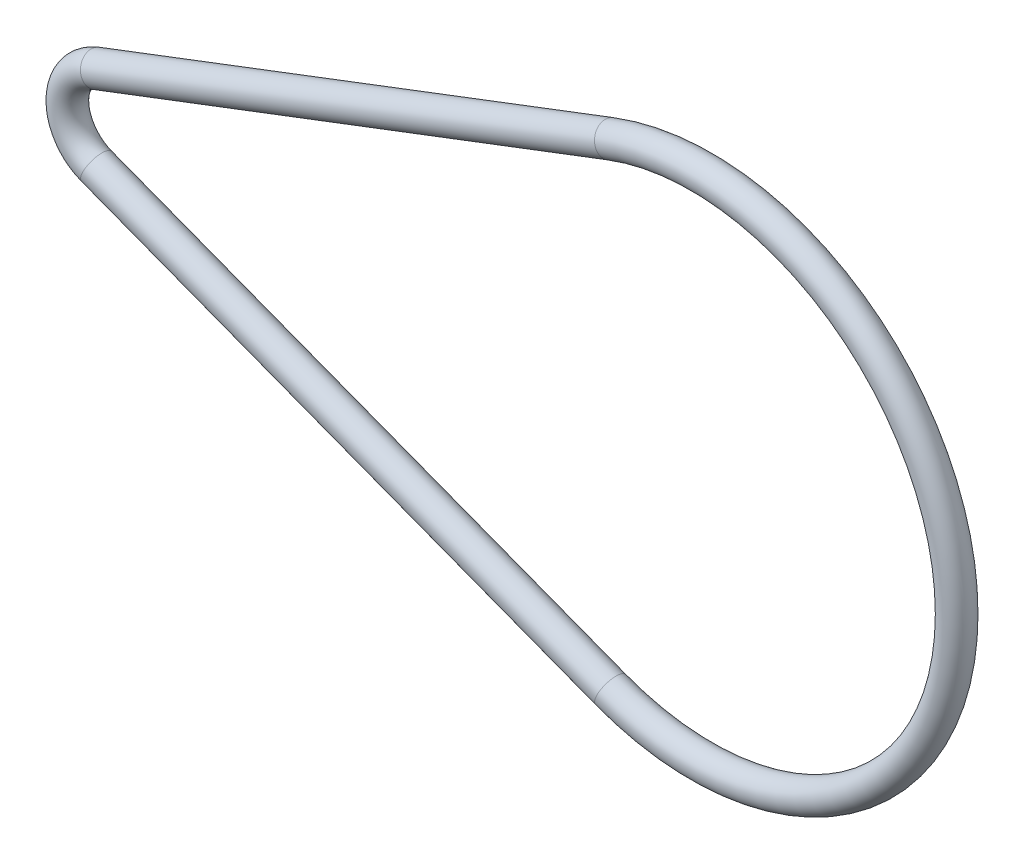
from build123d import *

# Parameters (mm, degrees)
ESQUISSE2_R = 1


with BuildPart() as part:
    # Balayage1: sweep along a path in Esquisse1
    with BuildLine(Plane.XY) as balayage1_path:
        Line((-1.069230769, 2.802988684), (32.976666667, 15.790169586))
        ThreePointArc((32.976666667, 15.790169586), (55.9, 0), (32.976666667, -15.790169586))
        Line((32.976666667, -15.790169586), (-1.069230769, -2.802988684))
        ThreePointArc((-1.069230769, -2.802988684), (-3, 0), (-1.069230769, 2.802988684))
    # Esquisse2 → Balayage1 (sweep)
    with BuildSketch(Plane(origin=(0, 0, 0), x_dir=(1, 0, 0), z_dir=(0, 1, 0))):
        with Locations((55.9, 0)):
            Circle(ESQUISSE2_R)
    sweep(path=balayage1_path.line)


solid = part.part
